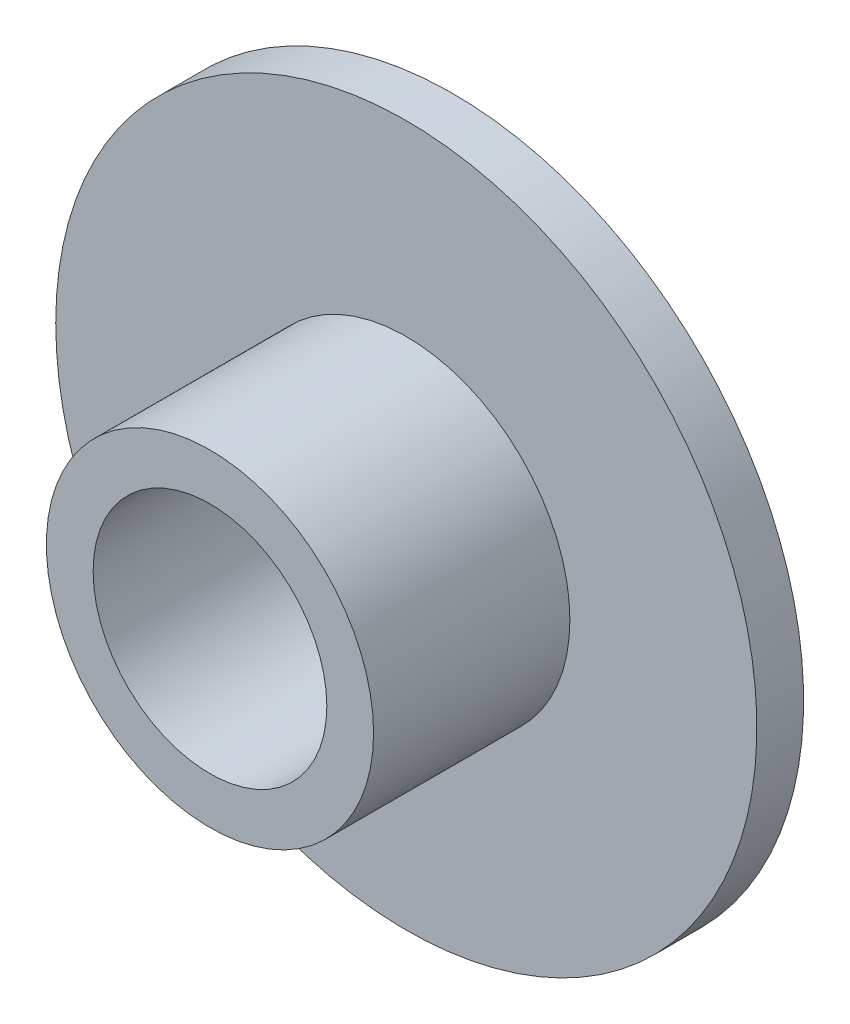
from build123d import *
from build123d.topology import SkipClean

# Parameters (mm, degrees)
SKETCH_1_R      = 3.5
SKETCH_1_R_2    = 2.5
EXTRUDE_1_DEPTH = 4.2
EXTRUDE_START   = 1
SKETCH_2_R      = 7.5
SKETCH_2_R_2    = 2.5
EXTRUDE_2_DEPTH = 1


with BuildPart() as part:
    # Sketch 1 → Extrude 1 (new body)
    with BuildSketch(Plane.XY):
        Circle(SKETCH_1_R)
        Circle(SKETCH_1_R_2, mode=Mode.SUBTRACT)
    extrude(amount=EXTRUDE_1_DEPTH)

    # Sketch 2 → Extrude 2 (add)
    with SkipClean():  # the faces are left unmerged after this step: merging them gives an invalid solid
        with BuildSketch(Plane(origin=(0, 0, 0), x_dir=(-1, 0, 0), z_dir=(0, 0, -1)).offset(EXTRUDE_START)):
            Circle(SKETCH_2_R)
            Circle(SKETCH_2_R_2, mode=Mode.SUBTRACT)
        extrude(amount=-EXTRUDE_2_DEPTH)


solid = part.part
